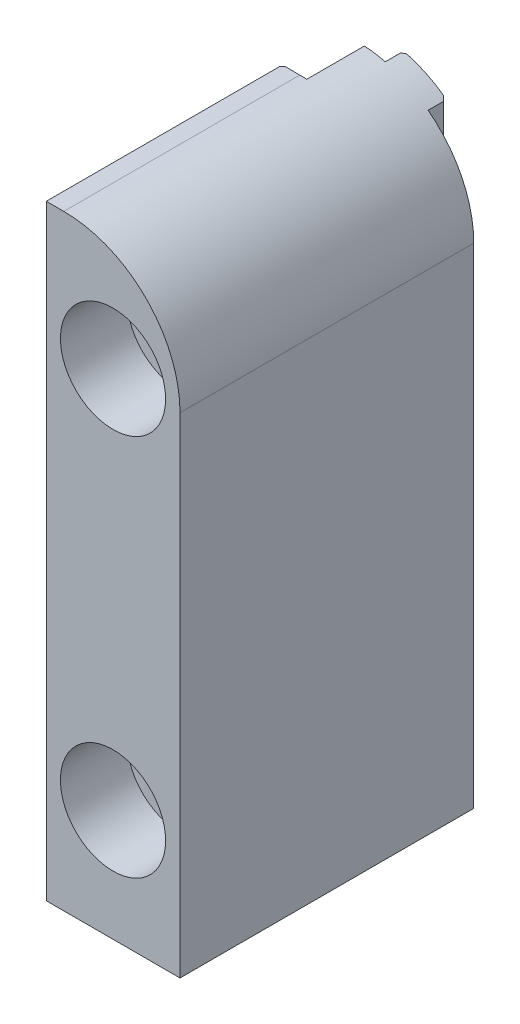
ISO-10303-21;
HEADER;
FILE_DESCRIPTION(('STEP AP214'),'2;1');
FILE_NAME('part.step','',(''),(''),'','','');
FILE_SCHEMA(('AUTOMOTIVE_DESIGN { 1 0 10303 214 1 1 1 1 }'));
ENDSEC;
DATA;
#1=APPLICATION_CONTEXT('core data for automotive mechanical design processes');
#2=APPLICATION_PROTOCOL_DEFINITION('international standard','automotive_design',2000,#1);
#3=PRODUCT_CONTEXT('',#1,'mechanical');
#4=PRODUCT('Part','Part','',(#3));
#5=PRODUCT_RELATED_PRODUCT_CATEGORY('part','',(#4));
#6=PRODUCT_DEFINITION_FORMATION('','',#4);
#7=PRODUCT_DEFINITION_CONTEXT('part definition',#1,'design');
#8=PRODUCT_DEFINITION('design','',#6,#7);
#9=PRODUCT_DEFINITION_SHAPE('','',#8);
#10=(LENGTH_UNIT() NAMED_UNIT(*) SI_UNIT(.MILLI.,.METRE.));
#11=(NAMED_UNIT(*) PLANE_ANGLE_UNIT() SI_UNIT($,.RADIAN.));
#12=(NAMED_UNIT(*) SI_UNIT($,.STERADIAN.) SOLID_ANGLE_UNIT());
#13=UNCERTAINTY_MEASURE_WITH_UNIT(LENGTH_MEASURE(1.E-05),#10,'distance_accuracy_value','');
#14=(GEOMETRIC_REPRESENTATION_CONTEXT(3) GLOBAL_UNCERTAINTY_ASSIGNED_CONTEXT((#13)) GLOBAL_UNIT_ASSIGNED_CONTEXT((#10,
#11,#12)) REPRESENTATION_CONTEXT('',''));
#15=CARTESIAN_POINT('',(0.,0.,0.));
#16=DIRECTION('',(0.,0.,1.));
#17=DIRECTION('',(1.,0.,0.));
#18=AXIS2_PLACEMENT_3D('',#15,#16,#17);
#19=CARTESIAN_POINT('',(7.32028,25.146,-24.384));
#20=DIRECTION('',(0.,0.,-1.));
#21=DIRECTION('',(-1.,0.,0.));
#22=AXIS2_PLACEMENT_3D('',#19,#20,#21);
#23=PLANE('',#22);
#24=CARTESIAN_POINT('',(5.54228,15.875,-24.384));
#25=DIRECTION('',(0.,0.,1.));
#26=DIRECTION('',(1.,0.,0.));
#27=AXIS2_PLACEMENT_3D('',#24,#25,#26);
#28=CIRCLE('',#27,2.7051);
#29=CARTESIAN_POINT('',(8.24738,15.875,-24.384));
#30=VERTEX_POINT('',#29);
#31=EDGE_CURVE('E283',#30,#30,#28,.F.);
#32=ORIENTED_EDGE('',*,*,#31,.F.);
#33=EDGE_LOOP('',(#32));
#34=FACE_BOUND('',#33,.T.);
#35=CARTESIAN_POINT('',(5.54228,-15.875,-24.384));
#36=DIRECTION('',(0.,0.,1.));
#37=DIRECTION('',(1.,0.,0.));
#38=AXIS2_PLACEMENT_3D('',#35,#36,#37);
#39=CIRCLE('',#38,2.7051);
#40=CARTESIAN_POINT('',(8.24738,-15.875,-24.384));
#41=VERTEX_POINT('',#40);
#42=EDGE_CURVE('E279',#41,#41,#39,.F.);
#43=ORIENTED_EDGE('',*,*,#42,.F.);
#44=EDGE_LOOP('',(#43));
#45=FACE_BOUND('',#44,.T.);
#46=CARTESIAN_POINT('',(5.54228,15.875,-24.384));
#47=DIRECTION('',(0.,0.,-1.));
#48=DIRECTION('',(-1.,0.,0.));
#49=AXIS2_PLACEMENT_3D('',#46,#47,#48);
#50=CIRCLE('',#49,3.175);
#51=CARTESIAN_POINT('',(8.71727969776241,15.8736146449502,-24.384));
#52=VERTEX_POINT('',#51);
#53=CARTESIAN_POINT('',(8.71728,15.875,-24.384));
#54=VERTEX_POINT('',#53);
#55=EDGE_CURVE('E424',#52,#54,#50,.T.);
#56=ORIENTED_EDGE('',*,*,#55,.T.);
#57=DIRECTION('',(-1.,0.,0.));
#58=VECTOR('',#57,1.);
#59=CARTESIAN_POINT('',(7.32028,15.875,-24.384));
#60=LINE('',#59,#58);
#61=CARTESIAN_POINT('',(8.717534,15.875,-24.384));
#62=VERTEX_POINT('',#61);
#63=EDGE_CURVE('E622',#54,#62,#60,.F.);
#64=ORIENTED_EDGE('',*,*,#63,.T.);
#65=CARTESIAN_POINT('',(5.54228,15.875,-24.384));
#66=DIRECTION('',(0.,0.,-1.));
#67=DIRECTION('',(-1.,0.,0.));
#68=AXIS2_PLACEMENT_3D('',#65,#66,#67);
#69=CIRCLE('',#68,3.175254);
#70=CARTESIAN_POINT('',(7.32028,18.5057706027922,-24.384));
#71=VERTEX_POINT('',#70);
#72=EDGE_CURVE('E566',#71,#62,#69,.T.);
#73=ORIENTED_EDGE('',*,*,#72,.F.);
#74=DIRECTION('',(0.,-1.,0.));
#75=VECTOR('',#74,1.);
#76=CARTESIAN_POINT('',(7.32028,25.146,-24.384));
#77=LINE('',#76,#75);
#78=CARTESIAN_POINT('',(7.32028,23.1578581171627,-24.384));
#79=VERTEX_POINT('',#78);
#80=EDGE_CURVE('E457',#79,#71,#77,.T.);
#81=ORIENTED_EDGE('',*,*,#80,.F.);
#82=CARTESIAN_POINT('',(1.45288,15.494,-24.384));
#83=DIRECTION('',(0.,0.,-1.));
#84=DIRECTION('',(-1.,0.,0.));
#85=AXIS2_PLACEMENT_3D('',#82,#83,#84);
#86=CIRCLE('',#85,9.652);
#87=CARTESIAN_POINT('',(11.10488,15.494,-24.384));
#88=VERTEX_POINT('',#87);
#89=EDGE_CURVE('E336',#79,#88,#86,.T.);
#90=ORIENTED_EDGE('',*,*,#89,.T.);
#91=DIRECTION('',(0.,-1.,0.));
#92=VECTOR('',#91,1.);
#93=CARTESIAN_POINT('',(11.10488,25.146,-24.384));
#94=LINE('',#93,#92);
#95=CARTESIAN_POINT('',(11.10488,-25.146,-24.384));
#96=VERTEX_POINT('',#95);
#97=EDGE_CURVE('E311',#88,#96,#94,.T.);
#98=ORIENTED_EDGE('',*,*,#97,.T.);
#99=DIRECTION('',(1.,0.,0.));
#100=VECTOR('',#99,1.);
#101=CARTESIAN_POINT('',(7.32028,-25.146,-24.384));
#102=LINE('',#101,#100);
#103=CARTESIAN_POINT('',(7.32028,-25.146,-24.384));
#104=VERTEX_POINT('',#103);
#105=EDGE_CURVE('E447',#104,#96,#102,.T.);
#106=ORIENTED_EDGE('',*,*,#105,.F.);
#107=CARTESIAN_POINT('',(7.32028,-18.5057706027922,-24.384));
#108=VERTEX_POINT('',#107);
#109=EDGE_CURVE('E456',#108,#104,#77,.T.);
#110=ORIENTED_EDGE('',*,*,#109,.F.);
#111=CARTESIAN_POINT('',(5.54228,-15.875,-24.384));
#112=DIRECTION('',(0.,0.,-1.));
#113=DIRECTION('',(-1.,0.,0.));
#114=AXIS2_PLACEMENT_3D('',#111,#112,#113);
#115=CIRCLE('',#114,3.175254);
#116=CARTESIAN_POINT('',(8.71753369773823,-15.8763854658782,-24.384));
#117=VERTEX_POINT('',#116);
#118=EDGE_CURVE('E403',#117,#108,#115,.T.);
#119=ORIENTED_EDGE('',*,*,#118,.F.);
#120=DIRECTION('',(-0.999999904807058,0.000436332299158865,0.));
#121=VECTOR('',#120,1.);
#122=CARTESIAN_POINT('',(7.30238087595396,-15.8757679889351,-24.384));
#123=LINE('',#122,#121);
#124=CARTESIAN_POINT('',(8.71727969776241,-15.8763853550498,-24.384));
#125=VERTEX_POINT('',#124);
#126=EDGE_CURVE('E418',#117,#125,#123,.T.);
#127=ORIENTED_EDGE('',*,*,#126,.T.);
#128=CARTESIAN_POINT('',(5.54228,-15.875,-24.384));
#129=DIRECTION('',(0.,0.,-1.));
#130=DIRECTION('',(-1.,0.,0.));
#131=AXIS2_PLACEMENT_3D('',#128,#129,#130);
#132=CIRCLE('',#131,3.175);
#133=CARTESIAN_POINT('',(8.71728,-15.875,-24.384));
#134=VERTEX_POINT('',#133);
#135=EDGE_CURVE('E426',#125,#134,#132,.T.);
#136=ORIENTED_EDGE('',*,*,#135,.T.);
#137=DIRECTION('',(-1.,0.,0.));
#138=VECTOR('',#137,1.);
#139=CARTESIAN_POINT('',(7.32028,-15.875,-24.384));
#140=LINE('',#139,#138);
#141=CARTESIAN_POINT('',(8.717534,-15.875,-24.384));
#142=VERTEX_POINT('',#141);
#143=EDGE_CURVE('E421',#134,#142,#140,.F.);
#144=ORIENTED_EDGE('',*,*,#143,.T.);
#145=CARTESIAN_POINT('',(7.32028,-13.2442293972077,-24.384));
#146=VERTEX_POINT('',#145);
#147=EDGE_CURVE('E402',#146,#142,#115,.T.);
#148=ORIENTED_EDGE('',*,*,#147,.F.);
#149=CARTESIAN_POINT('',(7.32028,13.2442293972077,-24.384));
#150=VERTEX_POINT('',#149);
#151=EDGE_CURVE('E460',#150,#146,#77,.T.);
#152=ORIENTED_EDGE('',*,*,#151,.F.);
#153=CARTESIAN_POINT('',(8.71753369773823,15.8736145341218,-24.384));
#154=VERTEX_POINT('',#153);
#155=EDGE_CURVE('E565',#154,#150,#69,.T.);
#156=ORIENTED_EDGE('',*,*,#155,.F.);
#157=DIRECTION('',(-0.999999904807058,0.000436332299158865,0.));
#158=VECTOR('',#157,1.);
#159=CARTESIAN_POINT('',(7.31623442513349,15.8742259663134,-24.384));
#160=LINE('',#159,#158);
#161=EDGE_CURVE('E249',#154,#52,#160,.T.);
#162=ORIENTED_EDGE('',*,*,#161,.T.);
#163=EDGE_LOOP('',(#56,#64,#73,#81,#90,#98,#106,#110,#119,#127,#136,#144,#148,#152,#156,#162));
#164=FACE_BOUND('',#163,.T.);
#165=ADVANCED_FACE('F15',(#34,#45,#164),#23,.T.);
#166=CARTESIAN_POINT('',(5.54228,15.875,-13.9446));
#167=DIRECTION('',(0.,0.,1.));
#168=DIRECTION('',(-1.,0.,0.));
#169=AXIS2_PLACEMENT_3D('',#166,#167,#168);
#170=CONICAL_SURFACE('',#169,3.3147,0.785398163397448);
#171=CARTESIAN_POINT('',(5.54228,15.875,-13.9446));
#172=DIRECTION('',(0.,0.,1.));
#173=DIRECTION('',(1.,0.,0.));
#174=AXIS2_PLACEMENT_3D('',#171,#172,#173);
#175=CIRCLE('',#174,3.3147);
#176=CARTESIAN_POINT('',(8.85698,15.875,-13.9446));
#177=VERTEX_POINT('',#176);
#178=EDGE_CURVE('E293',#177,#177,#175,.T.);
#179=ORIENTED_EDGE('',*,*,#178,.T.);
#180=EDGE_LOOP('',(#179));
#181=FACE_BOUND('',#180,.T.);
#182=CARTESIAN_POINT('',(5.54228,15.875,-14.5542));
#183=DIRECTION('',(0.,0.,-1.));
#184=DIRECTION('',(-1.,0.,0.));
#185=AXIS2_PLACEMENT_3D('',#182,#183,#184);
#186=CIRCLE('',#185,2.7051);
#187=CARTESIAN_POINT('',(2.83718,15.875,-14.5542));
#188=VERTEX_POINT('',#187);
#189=EDGE_CURVE('E290',#188,#188,#186,.F.);
#190=ORIENTED_EDGE('',*,*,#189,.F.);
#191=EDGE_LOOP('',(#190));
#192=FACE_BOUND('',#191,.T.);
#193=CARTESIAN_POINT('',(5.54228,15.875,-14.0843));
#194=DIRECTION('',(0.,0.,1.));
#195=DIRECTION('',(1.,0.,0.));
#196=AXIS2_PLACEMENT_3D('',#193,#194,#195);
#197=CIRCLE('',#196,3.175);
#198=CARTESIAN_POINT('',(8.71727969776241,15.8736146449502,-14.0843));
#199=VERTEX_POINT('',#198);
#200=CARTESIAN_POINT('',(8.71728,15.875,-14.0843));
#201=VERTEX_POINT('',#200);
#202=EDGE_CURVE('E9',#199,#201,#197,.F.);
#203=ORIENTED_EDGE('',*,*,#202,.F.);
#204=DIRECTION('',(0.707106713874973,-0.000308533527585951,0.707106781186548));
#205=VECTOR('',#204,1.);
#206=CARTESIAN_POINT('',(5.54228,15.875,-17.2593));
#207=LINE('',#206,#205);
#208=CARTESIAN_POINT('',(8.71753369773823,15.8736145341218,-14.084046));
#209=VERTEX_POINT('',#208);
#210=EDGE_CURVE('E241',#209,#199,#207,.F.);
#211=ORIENTED_EDGE('',*,*,#210,.F.);
#212=CARTESIAN_POINT('',(5.54228,15.875,-14.084046));
#213=DIRECTION('',(0.,0.,1.));
#214=DIRECTION('',(1.,0.,0.));
#215=AXIS2_PLACEMENT_3D('',#212,#213,#214);
#216=CIRCLE('',#215,3.175254);
#217=CARTESIAN_POINT('',(8.717534,15.875,-14.084046));
#218=VERTEX_POINT('',#217);
#219=EDGE_CURVE('E233',#209,#218,#216,.F.);
#220=ORIENTED_EDGE('',*,*,#219,.T.);
#221=DIRECTION('',(0.707106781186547,0.,0.707106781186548));
#222=VECTOR('',#221,1.);
#223=CARTESIAN_POINT('',(5.54228,15.875,-17.2593));
#224=LINE('',#223,#222);
#225=EDGE_CURVE('E23',#201,#218,#224,.T.);
#226=ORIENTED_EDGE('',*,*,#225,.F.);
#227=EDGE_LOOP('',(#203,#211,#220,#226));
#228=FACE_BOUND('',#227,.T.);
#229=ADVANCED_FACE('F252',(#181,#192,#228),#170,.F.);
#230=CARTESIAN_POINT('',(3.76428,13.2442293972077,-24.384));
#231=VERTEX_POINT('',#230);
#232=CARTESIAN_POINT('',(3.76428,18.5057706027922,-24.384));
#233=VERTEX_POINT('',#232);
#234=EDGE_CURVE('E561',#231,#233,#69,.T.);
#235=ORIENTED_EDGE('',*,*,#234,.F.);
#236=DIRECTION('',(0.,-1.,0.));
#237=VECTOR('',#236,1.);
#238=CARTESIAN_POINT('',(3.76428,25.146,-24.384));
#239=LINE('',#238,#237);
#240=CARTESIAN_POINT('',(3.76428,-13.2442293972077,-24.384));
#241=VERTEX_POINT('',#240);
#242=EDGE_CURVE('E464',#231,#241,#239,.T.);
#243=ORIENTED_EDGE('',*,*,#242,.T.);
#244=CARTESIAN_POINT('',(3.76428,-18.5057706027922,-24.384));
#245=VERTEX_POINT('',#244);
#246=EDGE_CURVE('E395',#245,#241,#115,.T.);
#247=ORIENTED_EDGE('',*,*,#246,.F.);
#248=CARTESIAN_POINT('',(3.76428,-25.146,-24.384));
#249=VERTEX_POINT('',#248);
#250=EDGE_CURVE('E388',#245,#249,#239,.T.);
#251=ORIENTED_EDGE('',*,*,#250,.T.);
#252=DIRECTION('',(1.,0.,0.));
#253=VECTOR('',#252,1.);
#254=CARTESIAN_POINT('',(1.96088,-25.146,-24.384));
#255=LINE('',#254,#253);
#256=CARTESIAN_POINT('',(2.02438,-25.146,-24.384));
#257=VERTEX_POINT('',#256);
#258=EDGE_CURVE('E436',#257,#249,#255,.T.);
#259=ORIENTED_EDGE('',*,*,#258,.F.);
#260=DIRECTION('',(0.,-1.,0.));
#261=VECTOR('',#260,1.);
#262=CARTESIAN_POINT('',(2.02438,25.146,-24.384));
#263=LINE('',#262,#261);
#264=CARTESIAN_POINT('',(2.02438,25.1290657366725,-24.384));
#265=VERTEX_POINT('',#264);
#266=EDGE_CURVE('E330',#265,#257,#263,.T.);
#267=ORIENTED_EDGE('',*,*,#266,.F.);
#268=CARTESIAN_POINT('',(1.45288,15.494,-24.384));
#269=DIRECTION('',(0.,0.,-1.));
#270=DIRECTION('',(-1.,0.,0.));
#271=AXIS2_PLACEMENT_3D('',#268,#269,#270);
#272=CIRCLE('',#271,9.652);
#273=CARTESIAN_POINT('',(3.76428,24.8651543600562,-24.384));
#274=VERTEX_POINT('',#273);
#275=EDGE_CURVE('E473',#265,#274,#272,.T.);
#276=ORIENTED_EDGE('',*,*,#275,.T.);
#277=EDGE_CURVE('E461',#274,#233,#239,.T.);
#278=ORIENTED_EDGE('',*,*,#277,.T.);
#279=EDGE_LOOP('',(#235,#243,#247,#251,#259,#267,#276,#278));
#280=FACE_BOUND('',#279,.T.);
#281=ADVANCED_FACE('F512',(#280),#23,.T.);
#282=CARTESIAN_POINT('',(5.54228,-15.875,-13.9446));
#283=DIRECTION('',(0.,0.,1.));
#284=DIRECTION('',(-1.,0.,0.));
#285=AXIS2_PLACEMENT_3D('',#282,#283,#284);
#286=CONICAL_SURFACE('',#285,3.3147,0.785398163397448);
#287=CARTESIAN_POINT('',(5.54228,-15.875,-13.9446));
#288=DIRECTION('',(0.,0.,1.));
#289=DIRECTION('',(1.,0.,0.));
#290=AXIS2_PLACEMENT_3D('',#287,#288,#289);
#291=CIRCLE('',#290,3.3147);
#292=CARTESIAN_POINT('',(8.85698,-15.875,-13.9446));
#293=VERTEX_POINT('',#292);
#294=EDGE_CURVE('E287',#293,#293,#291,.T.);
#295=ORIENTED_EDGE('',*,*,#294,.T.);
#296=EDGE_LOOP('',(#295));
#297=FACE_BOUND('',#296,.T.);
#298=CARTESIAN_POINT('',(5.54228,-15.875,-14.5542));
#299=DIRECTION('',(0.,0.,-1.));
#300=DIRECTION('',(-1.,0.,0.));
#301=AXIS2_PLACEMENT_3D('',#298,#299,#300);
#302=CIRCLE('',#301,2.7051);
#303=CARTESIAN_POINT('',(2.83718,-15.875,-14.5542));
#304=VERTEX_POINT('',#303);
#305=EDGE_CURVE('E284',#304,#304,#302,.F.);
#306=ORIENTED_EDGE('',*,*,#305,.F.);
#307=EDGE_LOOP('',(#306));
#308=FACE_BOUND('',#307,.T.);
#309=CARTESIAN_POINT('',(5.54228,-15.875,-14.0843));
#310=DIRECTION('',(0.,0.,1.));
#311=DIRECTION('',(1.,0.,0.));
#312=AXIS2_PLACEMENT_3D('',#309,#310,#311);
#313=CIRCLE('',#312,3.175);
#314=CARTESIAN_POINT('',(8.71727969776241,-15.8763853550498,-14.0843));
#315=VERTEX_POINT('',#314);
#316=CARTESIAN_POINT('',(8.71728,-15.875,-14.0843));
#317=VERTEX_POINT('',#316);
#318=EDGE_CURVE('E242',#315,#317,#313,.F.);
#319=ORIENTED_EDGE('',*,*,#318,.F.);
#320=DIRECTION('',(0.707106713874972,-0.000308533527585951,0.707106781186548));
#321=VECTOR('',#320,1.);
#322=CARTESIAN_POINT('',(5.54228,-15.875,-17.2593));
#323=LINE('',#322,#321);
#324=CARTESIAN_POINT('',(8.71753369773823,-15.8763854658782,-14.084046));
#325=VERTEX_POINT('',#324);
#326=EDGE_CURVE('E259',#325,#315,#323,.F.);
#327=ORIENTED_EDGE('',*,*,#326,.F.);
#328=CARTESIAN_POINT('',(5.54228,-15.875,-14.084046));
#329=DIRECTION('',(0.,0.,1.));
#330=DIRECTION('',(1.,0.,0.));
#331=AXIS2_PLACEMENT_3D('',#328,#329,#330);
#332=CIRCLE('',#331,3.175254);
#333=CARTESIAN_POINT('',(8.717534,-15.875,-14.084046));
#334=VERTEX_POINT('',#333);
#335=EDGE_CURVE('E261',#325,#334,#332,.F.);
#336=ORIENTED_EDGE('',*,*,#335,.T.);
#337=DIRECTION('',(0.707106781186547,0.,0.707106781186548));
#338=VECTOR('',#337,1.);
#339=CARTESIAN_POINT('',(5.54228,-15.875,-17.2593));
#340=LINE('',#339,#338);
#341=EDGE_CURVE('E256',#317,#334,#340,.T.);
#342=ORIENTED_EDGE('',*,*,#341,.F.);
#343=EDGE_LOOP('',(#319,#327,#336,#342));
#344=FACE_BOUND('',#343,.T.);
#345=ADVANCED_FACE('F670',(#297,#308,#344),#286,.F.);
#346=CARTESIAN_POINT('',(3.76428,25.146,-24.384));
#347=DIRECTION('',(-1.,0.,0.));
#348=DIRECTION('',(0.,0.,1.));
#349=AXIS2_PLACEMENT_3D('',#346,#347,#348);
#350=PLANE('',#349);
#351=DIRECTION('',(0.,0.,1.));
#352=VECTOR('',#351,1.);
#353=CARTESIAN_POINT('',(3.76428,-18.5057706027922,-13.9446));
#354=LINE('',#353,#352);
#355=CARTESIAN_POINT('',(3.76428,-18.5057706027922,-25.654));
#356=VERTEX_POINT('',#355);
#357=EDGE_CURVE('E387',#356,#245,#354,.T.);
#358=ORIENTED_EDGE('',*,*,#357,.F.);
#359=DIRECTION('',(0.,1.,0.));
#360=VECTOR('',#359,1.);
#361=CARTESIAN_POINT('',(3.76428,25.146,-25.654));
#362=LINE('',#361,#360);
#363=CARTESIAN_POINT('',(3.76428,-25.146,-25.654));
#364=VERTEX_POINT('',#363);
#365=EDGE_CURVE('E306',#364,#356,#362,.T.);
#366=ORIENTED_EDGE('',*,*,#365,.F.);
#367=DIRECTION('',(0.,0.,-1.));
#368=VECTOR('',#367,1.);
#369=CARTESIAN_POINT('',(3.76428,-25.146,-24.384));
#370=LINE('',#369,#368);
#371=EDGE_CURVE('E386',#249,#364,#370,.T.);
#372=ORIENTED_EDGE('',*,*,#371,.F.);
#373=ORIENTED_EDGE('',*,*,#250,.F.);
#374=EDGE_LOOP('',(#358,#366,#372,#373));
#375=FACE_BOUND('',#374,.T.);
#376=ADVANCED_FACE('F384',(#375),#350,.T.);
#377=CARTESIAN_POINT('',(3.76428,25.146,-25.908));
#378=DIRECTION('',(0.,0.,-1.));
#379=DIRECTION('',(-1.,0.,0.));
#380=AXIS2_PLACEMENT_3D('',#377,#378,#379);
#381=PLANE('',#380);
#382=CARTESIAN_POINT('',(5.54228,15.875,-25.908));
#383=DIRECTION('',(0.,0.,-1.));
#384=DIRECTION('',(-1.,0.,0.));
#385=AXIS2_PLACEMENT_3D('',#382,#383,#384);
#386=CIRCLE('',#385,3.175254);
#387=CARTESIAN_POINT('',(7.06628,13.0893830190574,-25.908));
#388=VERTEX_POINT('',#387);
#389=CARTESIAN_POINT('',(4.01828,13.0893830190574,-25.908));
#390=VERTEX_POINT('',#389);
#391=EDGE_CURVE('E584',#388,#390,#386,.T.);
#392=ORIENTED_EDGE('',*,*,#391,.F.);
#393=DIRECTION('',(0.,1.,0.));
#394=VECTOR('',#393,1.);
#395=CARTESIAN_POINT('',(7.06628,25.146,-25.908));
#396=LINE('',#395,#394);
#397=CARTESIAN_POINT('',(7.06628,-13.0893830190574,-25.908));
#398=VERTEX_POINT('',#397);
#399=EDGE_CURVE('E348',#398,#388,#396,.T.);
#400=ORIENTED_EDGE('',*,*,#399,.F.);
#401=CARTESIAN_POINT('',(5.54228,-15.875,-25.908));
#402=DIRECTION('',(0.,0.,-1.));
#403=DIRECTION('',(-1.,0.,0.));
#404=AXIS2_PLACEMENT_3D('',#401,#402,#403);
#405=CIRCLE('',#404,3.175254);
#406=CARTESIAN_POINT('',(4.01828,-13.0893830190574,-25.908));
#407=VERTEX_POINT('',#406);
#408=EDGE_CURVE('E410',#407,#398,#405,.T.);
#409=ORIENTED_EDGE('',*,*,#408,.F.);
#410=DIRECTION('',(0.,-1.,0.));
#411=VECTOR('',#410,1.);
#412=CARTESIAN_POINT('',(4.01828,25.146,-25.908));
#413=LINE('',#412,#411);
#414=EDGE_CURVE('E351',#390,#407,#413,.T.);
#415=ORIENTED_EDGE('',*,*,#414,.F.);
#416=EDGE_LOOP('',(#392,#400,#409,#415));
#417=FACE_BOUND('',#416,.T.);
#418=ADVANCED_FACE('F582',(#417),#381,.T.);
#419=CARTESIAN_POINT('',(7.32028,25.146,-25.908));
#420=DIRECTION('',(1.,0.,0.));
#421=DIRECTION('',(0.,0.,-1.));
#422=AXIS2_PLACEMENT_3D('',#419,#420,#421);
#423=PLANE('',#422);
#424=DIRECTION('',(0.,0.,1.));
#425=VECTOR('',#424,1.);
#426=CARTESIAN_POINT('',(7.32028,13.2442293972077,-13.9446));
#427=LINE('',#426,#425);
#428=CARTESIAN_POINT('',(7.32028,13.2442293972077,-25.654));
#429=VERTEX_POINT('',#428);
#430=EDGE_CURVE('E30',#150,#429,#427,.F.);
#431=ORIENTED_EDGE('',*,*,#430,.F.);
#432=ORIENTED_EDGE('',*,*,#151,.T.);
#433=DIRECTION('',(0.,0.,1.));
#434=VECTOR('',#433,1.);
#435=CARTESIAN_POINT('',(7.32028,-13.2442293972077,-13.9446));
#436=LINE('',#435,#434);
#437=CARTESIAN_POINT('',(7.32028,-13.2442293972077,-25.654));
#438=VERTEX_POINT('',#437);
#439=EDGE_CURVE('E415',#438,#146,#436,.T.);
#440=ORIENTED_EDGE('',*,*,#439,.F.);
#441=DIRECTION('',(0.,-1.,0.));
#442=VECTOR('',#441,1.);
#443=CARTESIAN_POINT('',(7.32028,25.146,-25.654));
#444=LINE('',#443,#442);
#445=EDGE_CURVE('E356',#429,#438,#444,.T.);
#446=ORIENTED_EDGE('',*,*,#445,.F.);
#447=EDGE_LOOP('',(#431,#432,#440,#446));
#448=FACE_BOUND('',#447,.T.);
#449=ADVANCED_FACE('F592',(#448),#423,.T.);
#450=DIRECTION('',(0.,0.,1.));
#451=VECTOR('',#450,1.);
#452=CARTESIAN_POINT('',(3.76428,13.2442293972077,-13.9446));
#453=LINE('',#452,#451);
#454=CARTESIAN_POINT('',(3.76428,13.2442293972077,-25.654));
#455=VERTEX_POINT('',#454);
#456=EDGE_CURVE('E563',#455,#231,#453,.T.);
#457=ORIENTED_EDGE('',*,*,#456,.F.);
#458=DIRECTION('',(0.,1.,0.));
#459=VECTOR('',#458,1.);
#460=CARTESIAN_POINT('',(3.76428,25.146,-25.654));
#461=LINE('',#460,#459);
#462=CARTESIAN_POINT('',(3.76428,-13.2442293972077,-25.654));
#463=VERTEX_POINT('',#462);
#464=EDGE_CURVE('E353',#463,#455,#461,.T.);
#465=ORIENTED_EDGE('',*,*,#464,.F.);
#466=DIRECTION('',(0.,0.,1.));
#467=VECTOR('',#466,1.);
#468=CARTESIAN_POINT('',(3.76428,-13.2442293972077,-13.9446));
#469=LINE('',#468,#467);
#470=EDGE_CURVE('E405',#241,#463,#469,.F.);
#471=ORIENTED_EDGE('',*,*,#470,.F.);
#472=ORIENTED_EDGE('',*,*,#242,.F.);
#473=EDGE_LOOP('',(#457,#465,#471,#472));
#474=FACE_BOUND('',#473,.T.);
#475=ADVANCED_FACE('F570',(#474),#350,.T.);
#476=CARTESIAN_POINT('',(5.54228,15.875,-25.908));
#477=DIRECTION('',(0.,0.,-1.));
#478=DIRECTION('',(-1.,0.,0.));
#479=AXIS2_PLACEMENT_3D('',#476,#477,#478);
#480=CIRCLE('',#479,3.175254);
#481=CARTESIAN_POINT('',(4.01828,18.6606169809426,-25.908));
#482=VERTEX_POINT('',#481);
#483=CARTESIAN_POINT('',(7.06628,18.6606169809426,-25.908));
#484=VERTEX_POINT('',#483);
#485=EDGE_CURVE('E554',#482,#484,#480,.T.);
#486=ORIENTED_EDGE('',*,*,#485,.F.);
#487=DIRECTION('',(0.,-1.,0.));
#488=VECTOR('',#487,1.);
#489=CARTESIAN_POINT('',(4.01828,25.146,-25.908));
#490=LINE('',#489,#488);
#491=CARTESIAN_POINT('',(4.01828,24.7988281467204,-25.908));
#492=VERTEX_POINT('',#491);
#493=EDGE_CURVE('E335',#492,#482,#490,.T.);
#494=ORIENTED_EDGE('',*,*,#493,.F.);
#495=CARTESIAN_POINT('',(1.45288,15.494,-25.908));
#496=DIRECTION('',(0.,0.,-1.));
#497=DIRECTION('',(-1.,0.,0.));
#498=AXIS2_PLACEMENT_3D('',#495,#496,#497);
#499=CIRCLE('',#498,9.652);
#500=CARTESIAN_POINT('',(7.06628,23.3458051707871,-25.908));
#501=VERTEX_POINT('',#500);
#502=EDGE_CURVE('E472',#492,#501,#499,.T.);
#503=ORIENTED_EDGE('',*,*,#502,.T.);
#504=DIRECTION('',(0.,1.,0.));
#505=VECTOR('',#504,1.);
#506=CARTESIAN_POINT('',(7.06628,25.146,-25.908));
#507=LINE('',#506,#505);
#508=EDGE_CURVE('E333',#484,#501,#507,.T.);
#509=ORIENTED_EDGE('',*,*,#508,.F.);
#510=EDGE_LOOP('',(#486,#494,#503,#509));
#511=FACE_BOUND('',#510,.T.);
#512=ADVANCED_FACE('F552',(#511),#381,.T.);
#513=DIRECTION('',(0.,0.,1.));
#514=VECTOR('',#513,1.);
#515=CARTESIAN_POINT('',(7.32028,18.5057706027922,-13.9446));
#516=LINE('',#515,#514);
#517=CARTESIAN_POINT('',(7.32028,18.5057706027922,-25.654));
#518=VERTEX_POINT('',#517);
#519=EDGE_CURVE('E544',#518,#71,#516,.T.);
#520=ORIENTED_EDGE('',*,*,#519,.F.);
#521=DIRECTION('',(0.,-1.,0.));
#522=VECTOR('',#521,1.);
#523=CARTESIAN_POINT('',(7.32028,25.146,-25.654));
#524=LINE('',#523,#522);
#525=CARTESIAN_POINT('',(7.32028,23.1578581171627,-25.654));
#526=VERTEX_POINT('',#525);
#527=EDGE_CURVE('E345',#526,#518,#524,.T.);
#528=ORIENTED_EDGE('',*,*,#527,.F.);
#529=DIRECTION('',(0.,0.,1.));
#530=VECTOR('',#529,1.);
#531=CARTESIAN_POINT('',(7.32028,23.1578581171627,-25.908));
#532=LINE('',#531,#530);
#533=EDGE_CURVE('E476',#526,#79,#532,.T.);
#534=ORIENTED_EDGE('',*,*,#533,.T.);
#535=ORIENTED_EDGE('',*,*,#80,.T.);
#536=EDGE_LOOP('',(#520,#528,#534,#535));
#537=FACE_BOUND('',#536,.T.);
#538=ADVANCED_FACE('F543',(#537),#423,.T.);
#539=CARTESIAN_POINT('',(11.10488,25.146,-24.384));
#540=DIRECTION('',(1.,0.,0.));
#541=DIRECTION('',(0.,0.,-1.));
#542=AXIS2_PLACEMENT_3D('',#539,#540,#541);
#543=PLANE('',#542);
#544=DIRECTION('',(0.,0.,1.));
#545=VECTOR('',#544,1.);
#546=CARTESIAN_POINT('',(11.10488,15.494,-24.384));
#547=LINE('',#546,#545);
#548=CARTESIAN_POINT('',(11.10488,15.494,0.));
#549=VERTEX_POINT('',#548);
#550=EDGE_CURVE('E294',#88,#549,#547,.T.);
#551=ORIENTED_EDGE('',*,*,#550,.T.);
#552=DIRECTION('',(0.,-1.,0.));
#553=VECTOR('',#552,1.);
#554=CARTESIAN_POINT('',(11.10488,25.146,0.));
#555=LINE('',#554,#553);
#556=CARTESIAN_POINT('',(11.10488,-25.146,0.));
#557=VERTEX_POINT('',#556);
#558=EDGE_CURVE('E298',#549,#557,#555,.T.);
#559=ORIENTED_EDGE('',*,*,#558,.T.);
#560=DIRECTION('',(0.,0.,1.));
#561=VECTOR('',#560,1.);
#562=CARTESIAN_POINT('',(11.10488,-25.146,-24.384));
#563=LINE('',#562,#561);
#564=EDGE_CURVE('E278',#96,#557,#563,.T.);
#565=ORIENTED_EDGE('',*,*,#564,.F.);
#566=ORIENTED_EDGE('',*,*,#97,.F.);
#567=EDGE_LOOP('',(#551,#559,#565,#566));
#568=FACE_BOUND('',#567,.T.);
#569=ADVANCED_FACE('F531',(#568),#543,.T.);
#570=CARTESIAN_POINT('',(11.10488,25.146,0.));
#571=DIRECTION('',(0.,0.,1.));
#572=DIRECTION('',(1.,0.,0.));
#573=AXIS2_PLACEMENT_3D('',#570,#571,#572);
#574=PLANE('',#573);
#575=CARTESIAN_POINT('',(5.54228,15.875,0.));
#576=DIRECTION('',(0.,0.,1.));
#577=DIRECTION('',(1.,0.,0.));
#578=AXIS2_PLACEMENT_3D('',#575,#576,#577);
#579=CIRCLE('',#578,4.365625);
#580=CARTESIAN_POINT('',(9.907905,15.875,0.));
#581=VERTEX_POINT('',#580);
#582=EDGE_CURVE('E265',#581,#581,#579,.T.);
#583=ORIENTED_EDGE('',*,*,#582,.F.);
#584=EDGE_LOOP('',(#583));
#585=FACE_BOUND('',#584,.T.);
#586=CARTESIAN_POINT('',(5.54228,-15.875,0.));
#587=DIRECTION('',(0.,0.,1.));
#588=DIRECTION('',(1.,0.,0.));
#589=AXIS2_PLACEMENT_3D('',#586,#587,#588);
#590=CIRCLE('',#589,4.365625);
#591=CARTESIAN_POINT('',(9.907905,-15.875,0.));
#592=VERTEX_POINT('',#591);
#593=EDGE_CURVE('E272',#592,#592,#590,.T.);
#594=ORIENTED_EDGE('',*,*,#593,.F.);
#595=EDGE_LOOP('',(#594));
#596=FACE_BOUND('',#595,.T.);
#597=ORIENTED_EDGE('',*,*,#558,.F.);
#598=CARTESIAN_POINT('',(1.45288,15.494,0.));
#599=DIRECTION('',(0.,0.,1.));
#600=DIRECTION('',(1.,0.,0.));
#601=AXIS2_PLACEMENT_3D('',#598,#599,#600);
#602=CIRCLE('',#601,9.652);
#603=CARTESIAN_POINT('',(1.45288,25.146,0.));
#604=VERTEX_POINT('',#603);
#605=EDGE_CURVE('E297',#549,#604,#602,.T.);
#606=ORIENTED_EDGE('',*,*,#605,.T.);
#607=DIRECTION('',(-1.,0.,0.));
#608=VECTOR('',#607,1.);
#609=CARTESIAN_POINT('',(11.10488,25.146,0.));
#610=LINE('',#609,#608);
#611=CARTESIAN_POINT('',(0.,25.146,0.));
#612=VERTEX_POINT('',#611);
#613=EDGE_CURVE('E449',#604,#612,#610,.T.);
#614=ORIENTED_EDGE('',*,*,#613,.T.);
#615=DIRECTION('',(0.,-1.,0.));
#616=VECTOR('',#615,1.);
#617=CARTESIAN_POINT('',(0.,25.146,0.));
#618=LINE('',#617,#616);
#619=CARTESIAN_POINT('',(0.,-25.146,0.));
#620=VERTEX_POINT('',#619);
#621=EDGE_CURVE('E329',#612,#620,#618,.T.);
#622=ORIENTED_EDGE('',*,*,#621,.T.);
#623=DIRECTION('',(-1.,0.,0.));
#624=VECTOR('',#623,1.);
#625=CARTESIAN_POINT('',(11.10488,-25.146,0.));
#626=LINE('',#625,#624);
#627=EDGE_CURVE('E432',#557,#620,#626,.T.);
#628=ORIENTED_EDGE('',*,*,#627,.F.);
#629=EDGE_LOOP('',(#597,#606,#614,#622,#628));
#630=FACE_BOUND('',#629,.T.);
#631=ADVANCED_FACE('F527',(#585,#596,#630),#574,.T.);
#632=CARTESIAN_POINT('',(0.,25.146,0.));
#633=DIRECTION('',(-1.,0.,0.));
#634=DIRECTION('',(0.,0.,1.));
#635=AXIS2_PLACEMENT_3D('',#632,#633,#634);
#636=PLANE('',#635);
#637=DIRECTION('',(0.,0.,-1.));
#638=VECTOR('',#637,1.);
#639=CARTESIAN_POINT('',(0.,-25.146,-19.59356));
#640=LINE('',#639,#638);
#641=CARTESIAN_POINT('',(0.,-25.146,-19.3548));
#642=VERTEX_POINT('',#641);
#643=EDGE_CURVE('E435',#620,#642,#640,.T.);
#644=ORIENTED_EDGE('',*,*,#643,.F.);
#645=ORIENTED_EDGE('',*,*,#621,.F.);
#646=DIRECTION('',(0.,0.,-1.));
#647=VECTOR('',#646,1.);
#648=CARTESIAN_POINT('',(0.,25.146,-19.59356));
#649=LINE('',#648,#647);
#650=CARTESIAN_POINT('',(0.,25.146,-19.3548));
#651=VERTEX_POINT('',#650);
#652=EDGE_CURVE('E312',#612,#651,#649,.T.);
#653=ORIENTED_EDGE('',*,*,#652,.T.);
#654=DIRECTION('',(0.,1.,0.));
#655=VECTOR('',#654,1.);
#656=CARTESIAN_POINT('',(0.,25.146,-19.3548));
#657=LINE('',#656,#655);
#658=EDGE_CURVE('E300',#642,#651,#657,.T.);
#659=ORIENTED_EDGE('',*,*,#658,.F.);
#660=EDGE_LOOP('',(#644,#645,#653,#659));
#661=FACE_BOUND('',#660,.T.);
#662=ADVANCED_FACE('F769',(#661),#636,.T.);
#663=CARTESIAN_POINT('',(-0.00380999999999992,25.146,-19.6088));
#664=DIRECTION('',(0.,0.,-1.));
#665=DIRECTION('',(-1.,0.,0.));
#666=AXIS2_PLACEMENT_3D('',#663,#664,#665);
#667=PLANE('',#666);
#668=DIRECTION('',(1.,0.,0.));
#669=VECTOR('',#668,1.);
#670=CARTESIAN_POINT('',(11.10488,25.146,-19.6088));
#671=LINE('',#670,#669);
#672=CARTESIAN_POINT('',(0.254,25.146,-19.6088));
#673=VERTEX_POINT('',#672);
#674=CARTESIAN_POINT('',(1.45288,25.146,-19.59356));
#675=VERTEX_POINT('',#674);
#676=EDGE_CURVE('E307',#673,#675,#671,.T.);
#677=ORIENTED_EDGE('',*,*,#676,.T.);
#678=CARTESIAN_POINT('',(1.45288,15.494,-19.6088));
#679=DIRECTION('',(0.,0.,1.));
#680=DIRECTION('',(1.,0.,0.));
#681=AXIS2_PLACEMENT_3D('',#678,#679,#680);
#682=CIRCLE('',#681,9.652);
#683=CARTESIAN_POINT('',(2.02438,25.1290657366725,-19.59356));
#684=VERTEX_POINT('',#683);
#685=EDGE_CURVE('E319',#675,#684,#682,.F.);
#686=ORIENTED_EDGE('',*,*,#685,.T.);
#687=DIRECTION('',(0.,-1.,0.));
#688=VECTOR('',#687,1.);
#689=CARTESIAN_POINT('',(2.02438,25.146,-19.6088));
#690=LINE('',#689,#688);
#691=CARTESIAN_POINT('',(2.02438,-25.146,-19.6088));
#692=VERTEX_POINT('',#691);
#693=EDGE_CURVE('E326',#684,#692,#690,.T.);
#694=ORIENTED_EDGE('',*,*,#693,.T.);
#695=DIRECTION('',(1.,0.,0.));
#696=VECTOR('',#695,1.);
#697=CARTESIAN_POINT('',(11.10488,-25.146,-19.6088));
#698=LINE('',#697,#696);
#699=CARTESIAN_POINT('',(0.254,-25.146,-19.6088));
#700=VERTEX_POINT('',#699);
#701=EDGE_CURVE('E317',#700,#692,#698,.T.);
#702=ORIENTED_EDGE('',*,*,#701,.F.);
#703=DIRECTION('',(0.,-1.,0.));
#704=VECTOR('',#703,1.);
#705=CARTESIAN_POINT('',(0.254,25.146,-19.6088));
#706=LINE('',#705,#704);
#707=EDGE_CURVE('E303',#673,#700,#706,.T.);
#708=ORIENTED_EDGE('',*,*,#707,.F.);
#709=EDGE_LOOP('',(#677,#686,#694,#702,#708));
#710=FACE_BOUND('',#709,.T.);
#711=ADVANCED_FACE('F519',(#710),#667,.T.);
#712=CARTESIAN_POINT('',(2.02438,25.146,-19.59356));
#713=DIRECTION('',(-1.,0.,0.));
#714=DIRECTION('',(0.,0.,1.));
#715=AXIS2_PLACEMENT_3D('',#712,#713,#714);
#716=PLANE('',#715);
#717=DIRECTION('',(0.,0.,-1.));
#718=VECTOR('',#717,1.);
#719=CARTESIAN_POINT('',(2.02438,-25.146,-19.59356));
#720=LINE('',#719,#718);
#721=EDGE_CURVE('E439',#692,#257,#720,.T.);
#722=ORIENTED_EDGE('',*,*,#721,.F.);
#723=ORIENTED_EDGE('',*,*,#693,.F.);
#724=DIRECTION('',(0.,0.,1.));
#725=VECTOR('',#724,1.);
#726=CARTESIAN_POINT('',(2.02438,25.1290657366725,-24.384));
#727=LINE('',#726,#725);
#728=EDGE_CURVE('E322',#684,#265,#727,.F.);
#729=ORIENTED_EDGE('',*,*,#728,.T.);
#730=ORIENTED_EDGE('',*,*,#266,.T.);
#731=EDGE_LOOP('',(#722,#723,#729,#730));
#732=FACE_BOUND('',#731,.T.);
#733=ADVANCED_FACE('F502',(#732),#716,.T.);
#734=DIRECTION('',(0.,0.,1.));
#735=VECTOR('',#734,1.);
#736=CARTESIAN_POINT('',(3.76428,18.5057706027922,-13.9446));
#737=LINE('',#736,#735);
#738=CARTESIAN_POINT('',(3.76428,18.5057706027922,-25.654));
#739=VERTEX_POINT('',#738);
#740=EDGE_CURVE('E560',#233,#739,#737,.F.);
#741=ORIENTED_EDGE('',*,*,#740,.F.);
#742=ORIENTED_EDGE('',*,*,#277,.F.);
#743=DIRECTION('',(0.,0.,1.));
#744=VECTOR('',#743,1.);
#745=CARTESIAN_POINT('',(3.76428,24.8651543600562,-24.384));
#746=LINE('',#745,#744);
#747=CARTESIAN_POINT('',(3.76428,24.8651543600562,-25.654));
#748=VERTEX_POINT('',#747);
#749=EDGE_CURVE('E469',#274,#748,#746,.F.);
#750=ORIENTED_EDGE('',*,*,#749,.T.);
#751=DIRECTION('',(0.,1.,0.));
#752=VECTOR('',#751,1.);
#753=CARTESIAN_POINT('',(3.76428,25.146,-25.654));
#754=LINE('',#753,#752);
#755=EDGE_CURVE('E339',#739,#748,#754,.T.);
#756=ORIENTED_EDGE('',*,*,#755,.F.);
#757=EDGE_LOOP('',(#741,#742,#750,#756));
#758=FACE_BOUND('',#757,.T.);
#759=ADVANCED_FACE('F559',(#758),#350,.T.);
#760=CARTESIAN_POINT('',(5.54228,-15.875,-25.908));
#761=DIRECTION('',(0.,0.,-1.));
#762=DIRECTION('',(-1.,0.,0.));
#763=AXIS2_PLACEMENT_3D('',#760,#761,#762);
#764=CIRCLE('',#763,3.175254);
#765=CARTESIAN_POINT('',(7.06628,-18.6606169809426,-25.908));
#766=VERTEX_POINT('',#765);
#767=CARTESIAN_POINT('',(4.01828,-18.6606169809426,-25.908));
#768=VERTEX_POINT('',#767);
#769=EDGE_CURVE('E393',#766,#768,#764,.T.);
#770=ORIENTED_EDGE('',*,*,#769,.F.);
#771=DIRECTION('',(0.,1.,0.));
#772=VECTOR('',#771,1.);
#773=CARTESIAN_POINT('',(7.06628,25.146,-25.908));
#774=LINE('',#773,#772);
#775=CARTESIAN_POINT('',(7.06628,-25.146,-25.908));
#776=VERTEX_POINT('',#775);
#777=EDGE_CURVE('E367',#776,#766,#774,.T.);
#778=ORIENTED_EDGE('',*,*,#777,.F.);
#779=DIRECTION('',(1.,0.,0.));
#780=VECTOR('',#779,1.);
#781=CARTESIAN_POINT('',(3.76428,-25.146,-25.908));
#782=LINE('',#781,#780);
#783=CARTESIAN_POINT('',(4.01828,-25.146,-25.908));
#784=VERTEX_POINT('',#783);
#785=EDGE_CURVE('E441',#784,#776,#782,.T.);
#786=ORIENTED_EDGE('',*,*,#785,.F.);
#787=DIRECTION('',(0.,-1.,0.));
#788=VECTOR('',#787,1.);
#789=CARTESIAN_POINT('',(4.01828,25.146,-25.908));
#790=LINE('',#789,#788);
#791=EDGE_CURVE('E366',#768,#784,#790,.T.);
#792=ORIENTED_EDGE('',*,*,#791,.F.);
#793=EDGE_LOOP('',(#770,#778,#786,#792));
#794=FACE_BOUND('',#793,.T.);
#795=ADVANCED_FACE('F611',(#794),#381,.T.);
#796=DIRECTION('',(0.,0.,1.));
#797=VECTOR('',#796,1.);
#798=CARTESIAN_POINT('',(7.32028,-18.5057706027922,-13.9446));
#799=LINE('',#798,#797);
#800=CARTESIAN_POINT('',(7.32028,-18.5057706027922,-25.654));
#801=VERTEX_POINT('',#800);
#802=EDGE_CURVE('E401',#108,#801,#799,.F.);
#803=ORIENTED_EDGE('',*,*,#802,.F.);
#804=ORIENTED_EDGE('',*,*,#109,.T.);
#805=DIRECTION('',(0.,0.,1.));
#806=VECTOR('',#805,1.);
#807=CARTESIAN_POINT('',(7.32028,-25.146,-25.908));
#808=LINE('',#807,#806);
#809=CARTESIAN_POINT('',(7.32028,-25.146,-25.654));
#810=VERTEX_POINT('',#809);
#811=EDGE_CURVE('E444',#810,#104,#808,.T.);
#812=ORIENTED_EDGE('',*,*,#811,.F.);
#813=DIRECTION('',(0.,-1.,0.));
#814=VECTOR('',#813,1.);
#815=CARTESIAN_POINT('',(7.32028,25.146,-25.654));
#816=LINE('',#815,#814);
#817=EDGE_CURVE('E358',#801,#810,#816,.T.);
#818=ORIENTED_EDGE('',*,*,#817,.F.);
#819=EDGE_LOOP('',(#803,#804,#812,#818));
#820=FACE_BOUND('',#819,.T.);
#821=ADVANCED_FACE('F604',(#820),#423,.T.);
#822=CARTESIAN_POINT('',(11.10488,25.146,-19.59356));
#823=DIRECTION('',(0.,1.,0.));
#824=DIRECTION('',(0.,0.,1.));
#825=AXIS2_PLACEMENT_3D('',#822,#823,#824);
#826=PLANE('',#825);
#827=ORIENTED_EDGE('',*,*,#652,.F.);
#828=ORIENTED_EDGE('',*,*,#613,.F.);
#829=DIRECTION('',(0.,0.,1.));
#830=VECTOR('',#829,1.);
#831=CARTESIAN_POINT('',(1.45288,25.146,-19.59356));
#832=LINE('',#831,#830);
#833=EDGE_CURVE('E323',#604,#675,#832,.F.);
#834=ORIENTED_EDGE('',*,*,#833,.T.);
#835=ORIENTED_EDGE('',*,*,#676,.F.);
#836=DIRECTION('',(-0.707106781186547,0.,0.707106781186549));
#837=VECTOR('',#836,1.);
#838=CARTESIAN_POINT('',(5.67182,25.146,-25.02662));
#839=LINE('',#838,#837);
#840=EDGE_CURVE('E264',#651,#673,#839,.F.);
#841=ORIENTED_EDGE('',*,*,#840,.F.);
#842=EDGE_LOOP('',(#827,#828,#834,#835,#841));
#843=FACE_BOUND('',#842,.T.);
#844=ADVANCED_FACE('F522',(#843),#826,.T.);
#845=CARTESIAN_POINT('',(11.10488,-25.146,-19.59356));
#846=DIRECTION('',(0.,1.,0.));
#847=DIRECTION('',(0.,0.,1.));
#848=AXIS2_PLACEMENT_3D('',#845,#846,#847);
#849=PLANE('',#848);
#850=ORIENTED_EDGE('',*,*,#811,.T.);
#851=ORIENTED_EDGE('',*,*,#105,.T.);
#852=ORIENTED_EDGE('',*,*,#564,.T.);
#853=ORIENTED_EDGE('',*,*,#627,.T.);
#854=ORIENTED_EDGE('',*,*,#643,.T.);
#855=DIRECTION('',(0.707106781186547,0.,-0.707106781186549));
#856=VECTOR('',#855,1.);
#857=CARTESIAN_POINT('',(0.254,-25.146,-19.6088));
#858=LINE('',#857,#856);
#859=EDGE_CURVE('E360',#700,#642,#858,.F.);
#860=ORIENTED_EDGE('',*,*,#859,.F.);
#861=ORIENTED_EDGE('',*,*,#701,.T.);
#862=ORIENTED_EDGE('',*,*,#721,.T.);
#863=ORIENTED_EDGE('',*,*,#258,.T.);
#864=ORIENTED_EDGE('',*,*,#371,.T.);
#865=DIRECTION('',(0.707106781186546,0.,-0.707106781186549));
#866=VECTOR('',#865,1.);
#867=CARTESIAN_POINT('',(4.01828,-25.146,-25.908));
#868=LINE('',#867,#866);
#869=EDGE_CURVE('E362',#784,#364,#868,.F.);
#870=ORIENTED_EDGE('',*,*,#869,.F.);
#871=ORIENTED_EDGE('',*,*,#785,.T.);
#872=DIRECTION('',(0.707106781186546,0.,0.707106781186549));
#873=VECTOR('',#872,1.);
#874=CARTESIAN_POINT('',(7.32028,-25.146,-25.654));
#875=LINE('',#874,#873);
#876=EDGE_CURVE('E364',#810,#776,#875,.F.);
#877=ORIENTED_EDGE('',*,*,#876,.F.);
#878=EDGE_LOOP('',(#850,#851,#852,#853,#854,#860,#861,#862,#863,#864,#870,#871,#877));
#879=FACE_BOUND('',#878,.T.);
#880=ADVANCED_FACE('F514',(#879),#849,.F.);
#881=CARTESIAN_POINT('',(1.45288,15.494,-24.384));
#882=DIRECTION('',(0.,0.,1.));
#883=DIRECTION('',(0.,-1.,0.));
#884=AXIS2_PLACEMENT_3D('',#881,#882,#883);
#885=CYLINDRICAL_SURFACE('',#884,9.652);
#886=ORIENTED_EDGE('',*,*,#749,.F.);
#887=ORIENTED_EDGE('',*,*,#275,.F.);
#888=ORIENTED_EDGE('',*,*,#728,.F.);
#889=ORIENTED_EDGE('',*,*,#685,.F.);
#890=ORIENTED_EDGE('',*,*,#833,.F.);
#891=ORIENTED_EDGE('',*,*,#605,.F.);
#892=ORIENTED_EDGE('',*,*,#550,.F.);
#893=ORIENTED_EDGE('',*,*,#89,.F.);
#894=ORIENTED_EDGE('',*,*,#533,.F.);
#895=CARTESIAN_POINT('',(1.45288,15.494,-31.5214));
#896=DIRECTION('',(0.707106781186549,0.,-0.707106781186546));
#897=DIRECTION('',(0.707106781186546,0.,0.707106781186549));
#898=AXIS2_PLACEMENT_3D('',#895,#896,#897);
#899=ELLIPSE('',#898,13.6499893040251,9.652);
#900=EDGE_CURVE('E341',#501,#526,#899,.T.);
#901=ORIENTED_EDGE('',*,*,#900,.F.);
#902=ORIENTED_EDGE('',*,*,#502,.F.);
#903=CARTESIAN_POINT('',(1.45288,15.494,-23.3426));
#904=DIRECTION('',(-0.707106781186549,0.,-0.707106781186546));
#905=DIRECTION('',(-0.707106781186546,0.,0.707106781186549));
#906=AXIS2_PLACEMENT_3D('',#903,#904,#905);
#907=ELLIPSE('',#906,13.6499893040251,9.652);
#908=EDGE_CURVE('E343',#748,#492,#907,.T.);
#909=ORIENTED_EDGE('',*,*,#908,.F.);
#910=EDGE_LOOP('',(#886,#887,#888,#889,#890,#891,#892,#893,#894,#901,#902,#909));
#911=FACE_BOUND('',#910,.T.);
#912=ADVANCED_FACE('F507',(#911),#885,.T.);
#913=CARTESIAN_POINT('',(5.54228,-15.875,-5.5372));
#914=DIRECTION('',(0.,0.,1.));
#915=DIRECTION('',(1.,0.,0.));
#916=AXIS2_PLACEMENT_3D('',#913,#914,#915);
#917=CYLINDRICAL_SURFACE('',#916,4.365625);
#918=CARTESIAN_POINT('',(5.54228,-15.875,-5.5372));
#919=DIRECTION('',(0.,0.,1.));
#920=DIRECTION('',(1.,0.,0.));
#921=AXIS2_PLACEMENT_3D('',#918,#919,#920);
#922=CIRCLE('',#921,4.365625);
#923=CARTESIAN_POINT('',(9.907905,-15.875,-5.5372));
#924=VERTEX_POINT('',#923);
#925=EDGE_CURVE('E275',#924,#924,#922,.T.);
#926=ORIENTED_EDGE('',*,*,#925,.F.);
#927=EDGE_LOOP('',(#926));
#928=FACE_BOUND('',#927,.T.);
#929=ORIENTED_EDGE('',*,*,#593,.T.);
#930=EDGE_LOOP('',(#929));
#931=FACE_BOUND('',#930,.T.);
#932=ADVANCED_FACE('F704',(#928,#931),#917,.F.);
#933=CARTESIAN_POINT('',(5.54228,-15.875,-5.5372));
#934=DIRECTION('',(0.,0.,1.));
#935=DIRECTION('',(1.,0.,0.));
#936=AXIS2_PLACEMENT_3D('',#933,#934,#935);
#937=PLANE('',#936);
#938=CARTESIAN_POINT('',(5.54228,-15.875,-5.5372));
#939=DIRECTION('',(0.,0.,1.));
#940=DIRECTION('',(1.,0.,0.));
#941=AXIS2_PLACEMENT_3D('',#938,#939,#940);
#942=CIRCLE('',#941,3.3147);
#943=CARTESIAN_POINT('',(8.85698,-15.875,-5.5372));
#944=VERTEX_POINT('',#943);
#945=EDGE_CURVE('E282',#944,#944,#942,.T.);
#946=ORIENTED_EDGE('',*,*,#945,.F.);
#947=EDGE_LOOP('',(#946));
#948=FACE_BOUND('',#947,.T.);
#949=ORIENTED_EDGE('',*,*,#925,.T.);
#950=EDGE_LOOP('',(#949));
#951=FACE_BOUND('',#950,.T.);
#952=ADVANCED_FACE('F847',(#948,#951),#937,.T.);
#953=CARTESIAN_POINT('',(5.54228,15.875,-5.5372));
#954=DIRECTION('',(0.,0.,1.));
#955=DIRECTION('',(1.,0.,0.));
#956=AXIS2_PLACEMENT_3D('',#953,#954,#955);
#957=CYLINDRICAL_SURFACE('',#956,4.365625);
#958=CARTESIAN_POINT('',(5.54228,15.875,-5.5372));
#959=DIRECTION('',(0.,0.,1.));
#960=DIRECTION('',(1.,0.,0.));
#961=AXIS2_PLACEMENT_3D('',#958,#959,#960);
#962=CIRCLE('',#961,4.365625);
#963=CARTESIAN_POINT('',(9.907905,15.875,-5.5372));
#964=VERTEX_POINT('',#963);
#965=EDGE_CURVE('E268',#964,#964,#962,.T.);
#966=ORIENTED_EDGE('',*,*,#965,.F.);
#967=EDGE_LOOP('',(#966));
#968=FACE_BOUND('',#967,.T.);
#969=ORIENTED_EDGE('',*,*,#582,.T.);
#970=EDGE_LOOP('',(#969));
#971=FACE_BOUND('',#970,.T.);
#972=ADVANCED_FACE('F17',(#968,#971),#957,.F.);
#973=CARTESIAN_POINT('',(5.54228,15.875,-5.5372));
#974=DIRECTION('',(0.,0.,1.));
#975=DIRECTION('',(1.,0.,0.));
#976=AXIS2_PLACEMENT_3D('',#973,#974,#975);
#977=PLANE('',#976);
#978=CARTESIAN_POINT('',(5.54228,15.875,-5.5372));
#979=DIRECTION('',(0.,0.,1.));
#980=DIRECTION('',(1.,0.,0.));
#981=AXIS2_PLACEMENT_3D('',#978,#979,#980);
#982=CIRCLE('',#981,3.3147);
#983=CARTESIAN_POINT('',(8.85698,15.875,-5.5372));
#984=VERTEX_POINT('',#983);
#985=EDGE_CURVE('E269',#984,#984,#982,.T.);
#986=ORIENTED_EDGE('',*,*,#985,.F.);
#987=EDGE_LOOP('',(#986));
#988=FACE_BOUND('',#987,.T.);
#989=ORIENTED_EDGE('',*,*,#965,.T.);
#990=EDGE_LOOP('',(#989));
#991=FACE_BOUND('',#990,.T.);
#992=ADVANCED_FACE('F867',(#988,#991),#977,.T.);
#993=CARTESIAN_POINT('',(5.54228,15.875,-254.));
#994=DIRECTION('',(0.,0.,1.));
#995=DIRECTION('',(1.,0.,0.));
#996=AXIS2_PLACEMENT_3D('',#993,#994,#995);
#997=CYLINDRICAL_SURFACE('',#996,3.3147);
#998=ORIENTED_EDGE('',*,*,#985,.T.);
#999=EDGE_LOOP('',(#998));
#1000=FACE_BOUND('',#999,.T.);
#1001=ORIENTED_EDGE('',*,*,#178,.F.);
#1002=EDGE_LOOP('',(#1001));
#1003=FACE_BOUND('',#1002,.T.);
#1004=ADVANCED_FACE('F877',(#1000,#1003),#997,.F.);
#1005=CARTESIAN_POINT('',(5.54228,-15.875,-254.));
#1006=DIRECTION('',(0.,0.,1.));
#1007=DIRECTION('',(1.,0.,0.));
#1008=AXIS2_PLACEMENT_3D('',#1005,#1006,#1007);
#1009=CYLINDRICAL_SURFACE('',#1008,3.3147);
#1010=ORIENTED_EDGE('',*,*,#945,.T.);
#1011=EDGE_LOOP('',(#1010));
#1012=FACE_BOUND('',#1011,.T.);
#1013=ORIENTED_EDGE('',*,*,#294,.F.);
#1014=EDGE_LOOP('',(#1013));
#1015=FACE_BOUND('',#1014,.T.);
#1016=ADVANCED_FACE('F888',(#1012,#1015),#1009,.F.);
#1017=CARTESIAN_POINT('',(5.54228,-15.875,-24.13));
#1018=DIRECTION('',(0.,0.,1.));
#1019=DIRECTION('',(1.,0.,0.));
#1020=AXIS2_PLACEMENT_3D('',#1017,#1018,#1019);
#1021=CYLINDRICAL_SURFACE('',#1020,2.7051);
#1022=ORIENTED_EDGE('',*,*,#305,.T.);
#1023=EDGE_LOOP('',(#1022));
#1024=FACE_BOUND('',#1023,.T.);
#1025=ORIENTED_EDGE('',*,*,#42,.T.);
#1026=EDGE_LOOP('',(#1025));
#1027=FACE_BOUND('',#1026,.T.);
#1028=ADVANCED_FACE('F899',(#1024,#1027),#1021,.F.);
#1029=CARTESIAN_POINT('',(5.54228,15.875,-24.13));
#1030=DIRECTION('',(0.,0.,1.));
#1031=DIRECTION('',(1.,0.,0.));
#1032=AXIS2_PLACEMENT_3D('',#1029,#1030,#1031);
#1033=CYLINDRICAL_SURFACE('',#1032,2.7051);
#1034=ORIENTED_EDGE('',*,*,#189,.T.);
#1035=EDGE_LOOP('',(#1034));
#1036=FACE_BOUND('',#1035,.T.);
#1037=ORIENTED_EDGE('',*,*,#31,.T.);
#1038=EDGE_LOOP('',(#1037));
#1039=FACE_BOUND('',#1038,.T.);
#1040=ADVANCED_FACE('F701',(#1036,#1039),#1033,.F.);
#1041=CARTESIAN_POINT('',(4.01828,25.146,-25.908));
#1042=DIRECTION('',(0.707106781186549,0.,0.707106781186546));
#1043=DIRECTION('',(-0.707106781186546,0.,0.707106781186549));
#1044=AXIS2_PLACEMENT_3D('',#1041,#1042,#1043);
#1045=PLANE('',#1044);
#1046=CARTESIAN_POINT('',(5.54228,15.875,-27.432));
#1047=DIRECTION('',(0.707106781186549,0.,0.707106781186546));
#1048=DIRECTION('',(-0.707106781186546,0.,0.707106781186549));
#1049=AXIS2_PLACEMENT_3D('',#1046,#1047,#1048);
#1050=ELLIPSE('',#1049,4.49048727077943,3.175254);
#1051=EDGE_CURVE('E629',#739,#482,#1050,.F.);
#1052=ORIENTED_EDGE('',*,*,#1051,.F.);
#1053=ORIENTED_EDGE('',*,*,#755,.T.);
#1054=ORIENTED_EDGE('',*,*,#908,.T.);
#1055=ORIENTED_EDGE('',*,*,#493,.T.);
#1056=EDGE_LOOP('',(#1052,#1053,#1054,#1055));
#1057=FACE_BOUND('',#1056,.T.);
#1058=ADVANCED_FACE('F698',(#1057),#1045,.F.);
#1059=CARTESIAN_POINT('',(7.32028,25.146,-25.654));
#1060=DIRECTION('',(-0.707106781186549,0.,0.707106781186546));
#1061=DIRECTION('',(-0.707106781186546,0.,-0.707106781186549));
#1062=AXIS2_PLACEMENT_3D('',#1059,#1060,#1061);
#1063=PLANE('',#1062);
#1064=CARTESIAN_POINT('',(5.54228,15.875,-27.432));
#1065=DIRECTION('',(-0.707106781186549,0.,0.707106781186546));
#1066=DIRECTION('',(0.707106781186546,0.,0.707106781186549));
#1067=AXIS2_PLACEMENT_3D('',#1064,#1065,#1066);
#1068=ELLIPSE('',#1067,4.49048727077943,3.175254);
#1069=EDGE_CURVE('E548',#484,#518,#1068,.F.);
#1070=ORIENTED_EDGE('',*,*,#1069,.F.);
#1071=ORIENTED_EDGE('',*,*,#508,.T.);
#1072=ORIENTED_EDGE('',*,*,#900,.T.);
#1073=ORIENTED_EDGE('',*,*,#527,.T.);
#1074=EDGE_LOOP('',(#1070,#1071,#1072,#1073));
#1075=FACE_BOUND('',#1074,.T.);
#1076=ADVANCED_FACE('F547',(#1075),#1063,.F.);
#1077=CARTESIAN_POINT('',(4.01828,25.146,-25.908));
#1078=DIRECTION('',(0.707106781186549,0.,0.707106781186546));
#1079=DIRECTION('',(-0.707106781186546,0.,0.707106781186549));
#1080=AXIS2_PLACEMENT_3D('',#1077,#1078,#1079);
#1081=PLANE('',#1080);
#1082=CARTESIAN_POINT('',(5.54228,15.875,-27.432));
#1083=DIRECTION('',(0.707106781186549,0.,0.707106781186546));
#1084=DIRECTION('',(-0.707106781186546,0.,0.707106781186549));
#1085=AXIS2_PLACEMENT_3D('',#1082,#1083,#1084);
#1086=ELLIPSE('',#1085,4.49048727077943,3.175254);
#1087=EDGE_CURVE('E579',#390,#455,#1086,.F.);
#1088=ORIENTED_EDGE('',*,*,#1087,.F.);
#1089=ORIENTED_EDGE('',*,*,#414,.T.);
#1090=CARTESIAN_POINT('',(5.54228,-15.875,-27.432));
#1091=DIRECTION('',(0.707106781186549,0.,0.707106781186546));
#1092=DIRECTION('',(-0.707106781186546,0.,0.707106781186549));
#1093=AXIS2_PLACEMENT_3D('',#1090,#1091,#1092);
#1094=ELLIPSE('',#1093,4.49048727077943,3.175254);
#1095=EDGE_CURVE('E407',#463,#407,#1094,.F.);
#1096=ORIENTED_EDGE('',*,*,#1095,.F.);
#1097=ORIENTED_EDGE('',*,*,#464,.T.);
#1098=EDGE_LOOP('',(#1088,#1089,#1096,#1097));
#1099=FACE_BOUND('',#1098,.T.);
#1100=ADVANCED_FACE('F577',(#1099),#1081,.F.);
#1101=CARTESIAN_POINT('',(7.32028,25.146,-25.654));
#1102=DIRECTION('',(-0.707106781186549,0.,0.707106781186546));
#1103=DIRECTION('',(-0.707106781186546,0.,-0.707106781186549));
#1104=AXIS2_PLACEMENT_3D('',#1101,#1102,#1103);
#1105=PLANE('',#1104);
#1106=CARTESIAN_POINT('',(5.54228,15.875,-27.432));
#1107=DIRECTION('',(-0.707106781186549,0.,0.707106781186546));
#1108=DIRECTION('',(0.707106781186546,0.,0.707106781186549));
#1109=AXIS2_PLACEMENT_3D('',#1106,#1107,#1108);
#1110=ELLIPSE('',#1109,4.49048727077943,3.175254);
#1111=EDGE_CURVE('E590',#429,#388,#1110,.F.);
#1112=ORIENTED_EDGE('',*,*,#1111,.F.);
#1113=ORIENTED_EDGE('',*,*,#445,.T.);
#1114=CARTESIAN_POINT('',(5.54228,-15.875,-27.432));
#1115=DIRECTION('',(-0.707106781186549,0.,0.707106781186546));
#1116=DIRECTION('',(0.707106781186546,0.,0.707106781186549));
#1117=AXIS2_PLACEMENT_3D('',#1114,#1115,#1116);
#1118=ELLIPSE('',#1117,4.49048727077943,3.175254);
#1119=EDGE_CURVE('E412',#398,#438,#1118,.F.);
#1120=ORIENTED_EDGE('',*,*,#1119,.F.);
#1121=ORIENTED_EDGE('',*,*,#399,.T.);
#1122=EDGE_LOOP('',(#1112,#1113,#1120,#1121));
#1123=FACE_BOUND('',#1122,.T.);
#1124=ADVANCED_FACE('F588',(#1123),#1105,.F.);
#1125=CARTESIAN_POINT('',(7.32028,25.146,-25.654));
#1126=DIRECTION('',(-0.707106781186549,0.,0.707106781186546));
#1127=DIRECTION('',(-0.707106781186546,0.,-0.707106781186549));
#1128=AXIS2_PLACEMENT_3D('',#1125,#1126,#1127);
#1129=PLANE('',#1128);
#1130=CARTESIAN_POINT('',(5.54228,-15.875,-27.432));
#1131=DIRECTION('',(-0.707106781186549,0.,0.707106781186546));
#1132=DIRECTION('',(0.707106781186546,0.,0.707106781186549));
#1133=AXIS2_PLACEMENT_3D('',#1130,#1131,#1132);
#1134=ELLIPSE('',#1133,4.49048727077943,3.175254);
#1135=EDGE_CURVE('E392',#801,#766,#1134,.F.);
#1136=ORIENTED_EDGE('',*,*,#1135,.F.);
#1137=ORIENTED_EDGE('',*,*,#817,.T.);
#1138=ORIENTED_EDGE('',*,*,#876,.T.);
#1139=ORIENTED_EDGE('',*,*,#777,.T.);
#1140=EDGE_LOOP('',(#1136,#1137,#1138,#1139));
#1141=FACE_BOUND('',#1140,.T.);
#1142=ADVANCED_FACE('F607',(#1141),#1129,.F.);
#1143=CARTESIAN_POINT('',(4.01828,25.146,-25.908));
#1144=DIRECTION('',(0.707106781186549,0.,0.707106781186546));
#1145=DIRECTION('',(-0.707106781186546,0.,0.707106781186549));
#1146=AXIS2_PLACEMENT_3D('',#1143,#1144,#1145);
#1147=PLANE('',#1146);
#1148=CARTESIAN_POINT('',(5.54228,-15.875,-27.432));
#1149=DIRECTION('',(0.707106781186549,0.,0.707106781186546));
#1150=DIRECTION('',(-0.707106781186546,0.,0.707106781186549));
#1151=AXIS2_PLACEMENT_3D('',#1148,#1149,#1150);
#1152=ELLIPSE('',#1151,4.49048727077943,3.175254);
#1153=EDGE_CURVE('E377',#768,#356,#1152,.F.);
#1154=ORIENTED_EDGE('',*,*,#1153,.F.);
#1155=ORIENTED_EDGE('',*,*,#791,.T.);
#1156=ORIENTED_EDGE('',*,*,#869,.T.);
#1157=ORIENTED_EDGE('',*,*,#365,.T.);
#1158=EDGE_LOOP('',(#1154,#1155,#1156,#1157));
#1159=FACE_BOUND('',#1158,.T.);
#1160=ADVANCED_FACE('F376',(#1159),#1147,.F.);
#1161=CARTESIAN_POINT('',(0.254,25.146,-19.6088));
#1162=DIRECTION('',(0.707106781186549,0.,0.707106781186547));
#1163=DIRECTION('',(-0.707106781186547,0.,0.707106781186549));
#1164=AXIS2_PLACEMENT_3D('',#1161,#1162,#1163);
#1165=PLANE('',#1164);
#1166=ORIENTED_EDGE('',*,*,#840,.T.);
#1167=ORIENTED_EDGE('',*,*,#707,.T.);
#1168=ORIENTED_EDGE('',*,*,#859,.T.);
#1169=ORIENTED_EDGE('',*,*,#658,.T.);
#1170=EDGE_LOOP('',(#1166,#1167,#1168,#1169));
#1171=FACE_BOUND('',#1170,.T.);
#1172=ADVANCED_FACE('F683',(#1171),#1165,.F.);
#1173=CARTESIAN_POINT('',(8.71728,-15.875,-20.2946));
#1174=DIRECTION('',(0.,-1.,0.));
#1175=DIRECTION('',(0.,0.,-1.));
#1176=AXIS2_PLACEMENT_3D('',#1173,#1174,#1175);
#1177=PLANE('',#1176);
#1178=DIRECTION('',(0.,0.,-1.));
#1179=VECTOR('',#1178,1.);
#1180=CARTESIAN_POINT('',(8.71728,-15.875,-13.9446));
#1181=LINE('',#1180,#1179);
#1182=EDGE_CURVE('E612',#317,#134,#1181,.T.);
#1183=ORIENTED_EDGE('',*,*,#1182,.F.);
#1184=ORIENTED_EDGE('',*,*,#341,.T.);
#1185=DIRECTION('',(0.,0.,1.));
#1186=VECTOR('',#1185,1.);
#1187=CARTESIAN_POINT('',(8.717534,-15.875,-13.9446));
#1188=LINE('',#1187,#1186);
#1189=EDGE_CURVE('E619',#334,#142,#1188,.F.);
#1190=ORIENTED_EDGE('',*,*,#1189,.T.);
#1191=ORIENTED_EDGE('',*,*,#143,.F.);
#1192=EDGE_LOOP('',(#1183,#1184,#1190,#1191));
#1193=FACE_BOUND('',#1192,.T.);
#1194=ADVANCED_FACE('F686',(#1193),#1177,.F.);
#1195=CARTESIAN_POINT('',(8.71727969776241,-15.8763853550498,-20.2946));
#1196=DIRECTION('',(-0.000436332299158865,-0.999999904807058,0.));
#1197=DIRECTION('',(0.,0.,-1.));
#1198=AXIS2_PLACEMENT_3D('',#1195,#1196,#1197);
#1199=PLANE('',#1198);
#1200=DIRECTION('',(0.,0.,1.));
#1201=VECTOR('',#1200,1.);
#1202=CARTESIAN_POINT('',(8.71753369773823,-15.8763854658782,-13.9446));
#1203=LINE('',#1202,#1201);
#1204=EDGE_CURVE('E601',#325,#117,#1203,.F.);
#1205=ORIENTED_EDGE('',*,*,#1204,.F.);
#1206=ORIENTED_EDGE('',*,*,#326,.T.);
#1207=DIRECTION('',(0.,0.,-1.));
#1208=VECTOR('',#1207,1.);
#1209=CARTESIAN_POINT('',(8.71727969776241,-15.8763853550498,-13.9446));
#1210=LINE('',#1209,#1208);
#1211=EDGE_CURVE('E614',#315,#125,#1210,.T.);
#1212=ORIENTED_EDGE('',*,*,#1211,.T.);
#1213=ORIENTED_EDGE('',*,*,#126,.F.);
#1214=EDGE_LOOP('',(#1205,#1206,#1212,#1213));
#1215=FACE_BOUND('',#1214,.T.);
#1216=ADVANCED_FACE('F979',(#1215),#1199,.T.);
#1217=CARTESIAN_POINT('',(5.54228,-15.875,-13.9446));
#1218=DIRECTION('',(0.,0.,1.));
#1219=DIRECTION('',(1.,0.,0.));
#1220=AXIS2_PLACEMENT_3D('',#1217,#1218,#1219);
#1221=CYLINDRICAL_SURFACE('',#1220,3.175);
#1222=ORIENTED_EDGE('',*,*,#1211,.F.);
#1223=ORIENTED_EDGE('',*,*,#318,.T.);
#1224=ORIENTED_EDGE('',*,*,#1182,.T.);
#1225=ORIENTED_EDGE('',*,*,#135,.F.);
#1226=EDGE_LOOP('',(#1222,#1223,#1224,#1225));
#1227=FACE_BOUND('',#1226,.T.);
#1228=ADVANCED_FACE('F989',(#1227),#1221,.T.);
#1229=CARTESIAN_POINT('',(5.54228,-15.875,-13.9446));
#1230=DIRECTION('',(0.,0.,1.));
#1231=DIRECTION('',(1.,0.,0.));
#1232=AXIS2_PLACEMENT_3D('',#1229,#1230,#1231);
#1233=CYLINDRICAL_SURFACE('',#1232,3.175254);
#1234=ORIENTED_EDGE('',*,*,#147,.T.);
#1235=ORIENTED_EDGE('',*,*,#1189,.F.);
#1236=ORIENTED_EDGE('',*,*,#335,.F.);
#1237=ORIENTED_EDGE('',*,*,#1204,.T.);
#1238=ORIENTED_EDGE('',*,*,#118,.T.);
#1239=ORIENTED_EDGE('',*,*,#802,.T.);
#1240=ORIENTED_EDGE('',*,*,#1135,.T.);
#1241=ORIENTED_EDGE('',*,*,#769,.T.);
#1242=ORIENTED_EDGE('',*,*,#1153,.T.);
#1243=ORIENTED_EDGE('',*,*,#357,.T.);
#1244=ORIENTED_EDGE('',*,*,#246,.T.);
#1245=ORIENTED_EDGE('',*,*,#470,.T.);
#1246=ORIENTED_EDGE('',*,*,#1095,.T.);
#1247=ORIENTED_EDGE('',*,*,#408,.T.);
#1248=ORIENTED_EDGE('',*,*,#1119,.T.);
#1249=ORIENTED_EDGE('',*,*,#439,.T.);
#1250=EDGE_LOOP('',(#1234,#1235,#1236,#1237,#1238,#1239,#1240,#1241,#1242,#1243,#1244,#1245,
#1246,#1247,#1248,#1249));
#1251=FACE_BOUND('',#1250,.T.);
#1252=ADVANCED_FACE('F573',(#1251),#1233,.F.);
#1253=CARTESIAN_POINT('',(8.71728,15.875,-20.2946));
#1254=DIRECTION('',(0.,-1.,0.));
#1255=DIRECTION('',(0.,0.,-1.));
#1256=AXIS2_PLACEMENT_3D('',#1253,#1254,#1255);
#1257=PLANE('',#1256);
#1258=DIRECTION('',(0.,0.,-1.));
#1259=VECTOR('',#1258,1.);
#1260=CARTESIAN_POINT('',(8.71728,15.875,-13.9446));
#1261=LINE('',#1260,#1259);
#1262=EDGE_CURVE('E637',#201,#54,#1261,.T.);
#1263=ORIENTED_EDGE('',*,*,#1262,.F.);
#1264=ORIENTED_EDGE('',*,*,#225,.T.);
#1265=DIRECTION('',(0.,0.,1.));
#1266=VECTOR('',#1265,1.);
#1267=CARTESIAN_POINT('',(8.717534,15.875,-13.9446));
#1268=LINE('',#1267,#1266);
#1269=EDGE_CURVE('E37',#218,#62,#1268,.F.);
#1270=ORIENTED_EDGE('',*,*,#1269,.T.);
#1271=ORIENTED_EDGE('',*,*,#63,.F.);
#1272=EDGE_LOOP('',(#1263,#1264,#1270,#1271));
#1273=FACE_BOUND('',#1272,.T.);
#1274=ADVANCED_FACE('F645',(#1273),#1257,.F.);
#1275=CARTESIAN_POINT('',(8.71727969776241,15.8736146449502,-20.2946));
#1276=DIRECTION('',(-0.000436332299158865,-0.999999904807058,0.));
#1277=DIRECTION('',(0.,0.,-1.));
#1278=AXIS2_PLACEMENT_3D('',#1275,#1276,#1277);
#1279=PLANE('',#1278);
#1280=DIRECTION('',(0.,0.,1.));
#1281=VECTOR('',#1280,1.);
#1282=CARTESIAN_POINT('',(8.71753369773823,15.8736145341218,-13.9446));
#1283=LINE('',#1282,#1281);
#1284=EDGE_CURVE('E236',#209,#154,#1283,.F.);
#1285=ORIENTED_EDGE('',*,*,#1284,.F.);
#1286=ORIENTED_EDGE('',*,*,#210,.T.);
#1287=DIRECTION('',(0.,0.,-1.));
#1288=VECTOR('',#1287,1.);
#1289=CARTESIAN_POINT('',(8.71727969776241,15.8736146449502,-13.9446));
#1290=LINE('',#1289,#1288);
#1291=EDGE_CURVE('E640',#199,#52,#1290,.T.);
#1292=ORIENTED_EDGE('',*,*,#1291,.T.);
#1293=ORIENTED_EDGE('',*,*,#161,.F.);
#1294=EDGE_LOOP('',(#1285,#1286,#1292,#1293));
#1295=FACE_BOUND('',#1294,.T.);
#1296=ADVANCED_FACE('F245',(#1295),#1279,.T.);
#1297=CARTESIAN_POINT('',(5.54228,15.875,-13.9446));
#1298=DIRECTION('',(0.,0.,1.));
#1299=DIRECTION('',(1.,0.,0.));
#1300=AXIS2_PLACEMENT_3D('',#1297,#1298,#1299);
#1301=CYLINDRICAL_SURFACE('',#1300,3.175);
#1302=ORIENTED_EDGE('',*,*,#1291,.F.);
#1303=ORIENTED_EDGE('',*,*,#202,.T.);
#1304=ORIENTED_EDGE('',*,*,#1262,.T.);
#1305=ORIENTED_EDGE('',*,*,#55,.F.);
#1306=EDGE_LOOP('',(#1302,#1303,#1304,#1305));
#1307=FACE_BOUND('',#1306,.T.);
#1308=ADVANCED_FACE('F647',(#1307),#1301,.T.);
#1309=CARTESIAN_POINT('',(5.54228,15.875,-13.9446));
#1310=DIRECTION('',(0.,0.,1.));
#1311=DIRECTION('',(1.,0.,0.));
#1312=AXIS2_PLACEMENT_3D('',#1309,#1310,#1311);
#1313=CYLINDRICAL_SURFACE('',#1312,3.175254);
#1314=ORIENTED_EDGE('',*,*,#72,.T.);
#1315=ORIENTED_EDGE('',*,*,#1269,.F.);
#1316=ORIENTED_EDGE('',*,*,#219,.F.);
#1317=ORIENTED_EDGE('',*,*,#1284,.T.);
#1318=ORIENTED_EDGE('',*,*,#155,.T.);
#1319=ORIENTED_EDGE('',*,*,#430,.T.);
#1320=ORIENTED_EDGE('',*,*,#1111,.T.);
#1321=ORIENTED_EDGE('',*,*,#391,.T.);
#1322=ORIENTED_EDGE('',*,*,#1087,.T.);
#1323=ORIENTED_EDGE('',*,*,#456,.T.);
#1324=ORIENTED_EDGE('',*,*,#234,.T.);
#1325=ORIENTED_EDGE('',*,*,#740,.T.);
#1326=ORIENTED_EDGE('',*,*,#1051,.T.);
#1327=ORIENTED_EDGE('',*,*,#485,.T.);
#1328=ORIENTED_EDGE('',*,*,#1069,.T.);
#1329=ORIENTED_EDGE('',*,*,#519,.T.);
#1330=EDGE_LOOP('',(#1314,#1315,#1316,#1317,#1318,#1319,#1320,#1321,#1322,#1323,#1324,#1325,
#1326,#1327,#1328,#1329));
#1331=FACE_BOUND('',#1330,.T.);
#1332=ADVANCED_FACE('F235',(#1331),#1313,.F.);
#1333=CLOSED_SHELL('',(#165,#229,#281,#345,#376,#418,#449,#475,#512,#538,#569,#631,#662,#711,
#733,#759,#795,#821,#844,#880,#912,#932,#952,#972,#992,#1004,#1016,#1028,#1040,#1058,#1076,
#1100,#1124,#1142,#1160,#1172,#1194,#1216,#1228,#1252,#1274,#1296,#1308,#1332));
#1334=MANIFOLD_SOLID_BREP('B1',#1333);
#1335=ADVANCED_BREP_SHAPE_REPRESENTATION('',(#18,#1334),#14);
#1336=SHAPE_DEFINITION_REPRESENTATION(#9,#1335);
ENDSEC;
END-ISO-10303-21;
